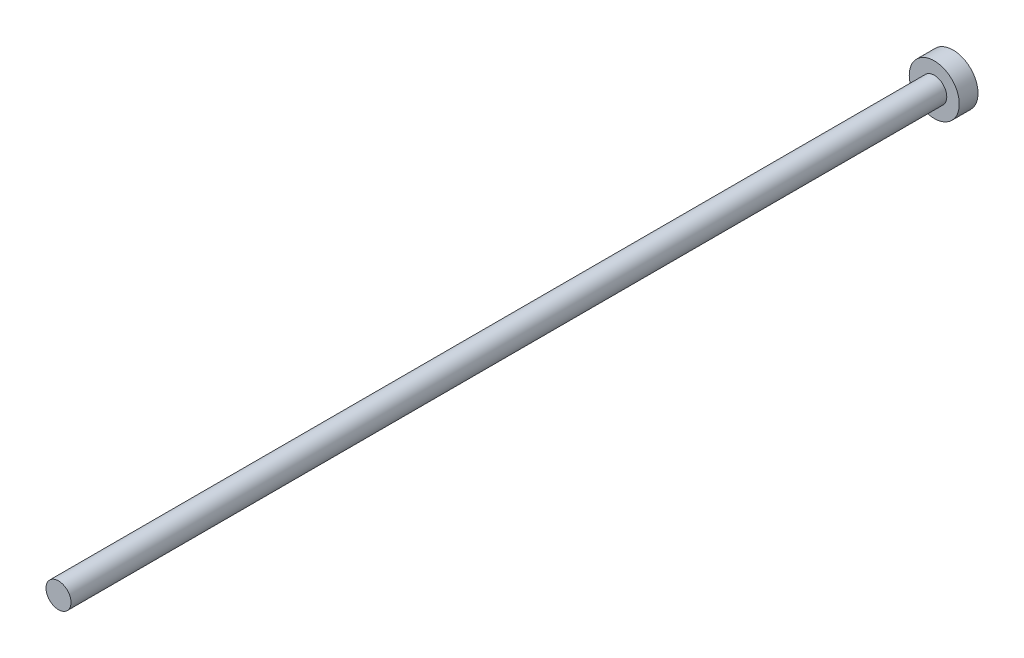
ISO-10303-21;
HEADER;
FILE_DESCRIPTION(('STEP AP214'),'2;1');
FILE_NAME('part.step','',(''),(''),'','','');
FILE_SCHEMA(('AUTOMOTIVE_DESIGN { 1 0 10303 214 1 1 1 1 }'));
ENDSEC;
DATA;
#1=APPLICATION_CONTEXT('core data for automotive mechanical design processes');
#2=APPLICATION_PROTOCOL_DEFINITION('international standard','automotive_design',2000,#1);
#3=PRODUCT_CONTEXT('',#1,'mechanical');
#4=PRODUCT('Part','Part','',(#3));
#5=PRODUCT_RELATED_PRODUCT_CATEGORY('part','',(#4));
#6=PRODUCT_DEFINITION_FORMATION('','',#4);
#7=PRODUCT_DEFINITION_CONTEXT('part definition',#1,'design');
#8=PRODUCT_DEFINITION('design','',#6,#7);
#9=PRODUCT_DEFINITION_SHAPE('','',#8);
#10=(LENGTH_UNIT() NAMED_UNIT(*) SI_UNIT(.MILLI.,.METRE.));
#11=(NAMED_UNIT(*) PLANE_ANGLE_UNIT() SI_UNIT($,.RADIAN.));
#12=(NAMED_UNIT(*) SI_UNIT($,.STERADIAN.) SOLID_ANGLE_UNIT());
#13=UNCERTAINTY_MEASURE_WITH_UNIT(LENGTH_MEASURE(1.E-05),#10,'distance_accuracy_value','');
#14=(GEOMETRIC_REPRESENTATION_CONTEXT(3) GLOBAL_UNCERTAINTY_ASSIGNED_CONTEXT((#13)) GLOBAL_UNIT_ASSIGNED_CONTEXT((#10,
#11,#12)) REPRESENTATION_CONTEXT('',''));
#15=CARTESIAN_POINT('',(0.,0.,0.));
#16=DIRECTION('',(0.,0.,1.));
#17=DIRECTION('',(1.,0.,0.));
#18=AXIS2_PLACEMENT_3D('',#15,#16,#17);
#19=CARTESIAN_POINT('',(80.0000083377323,36.261,-1415.7));
#20=DIRECTION('',(0.,0.,1.));
#21=DIRECTION('',(1.,0.,0.));
#22=AXIS2_PLACEMENT_3D('',#19,#20,#21);
#23=CYLINDRICAL_SURFACE('',#22,2.);
#24=CARTESIAN_POINT('',(80.0000083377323,36.261,0.));
#25=DIRECTION('',(0.,0.,-1.));
#26=DIRECTION('',(1.,0.,0.));
#27=AXIS2_PLACEMENT_3D('',#24,#25,#26);
#28=CIRCLE('',#27,2.);
#29=CARTESIAN_POINT('',(82.0000083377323,36.261,0.));
#30=VERTEX_POINT('',#29);
#31=EDGE_CURVE('E20',#30,#30,#28,.T.);
#32=ORIENTED_EDGE('',*,*,#31,.T.);
#33=EDGE_LOOP('',(#32));
#34=FACE_BOUND('',#33,.T.);
#35=CARTESIAN_POINT('',(80.0000083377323,36.261,-140.));
#36=DIRECTION('',(0.,0.,-1.));
#37=DIRECTION('',(-1.,0.,0.));
#38=AXIS2_PLACEMENT_3D('',#35,#36,#37);
#39=CIRCLE('',#38,2.);
#40=CARTESIAN_POINT('',(78.0000083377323,36.261,-140.));
#41=VERTEX_POINT('',#40);
#42=EDGE_CURVE('E10',#41,#41,#39,.T.);
#43=ORIENTED_EDGE('',*,*,#42,.F.);
#44=EDGE_LOOP('',(#43));
#45=FACE_BOUND('',#44,.T.);
#46=ADVANCED_FACE('F14',(#34,#45),#23,.T.);
#47=CARTESIAN_POINT('',(80.0000083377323,36.261,0.));
#48=DIRECTION('',(0.,0.,-1.));
#49=DIRECTION('',(-1.,0.,0.));
#50=AXIS2_PLACEMENT_3D('',#47,#48,#49);
#51=PLANE('',#50);
#52=ORIENTED_EDGE('',*,*,#31,.F.);
#53=EDGE_LOOP('',(#52));
#54=FACE_BOUND('',#53,.T.);
#55=ADVANCED_FACE('F46',(#54),#51,.F.);
#56=CARTESIAN_POINT('',(11.2500080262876,30.,-140.));
#57=DIRECTION('',(0.,0.,-1.));
#58=DIRECTION('',(-1.,0.,0.));
#59=AXIS2_PLACEMENT_3D('',#56,#57,#58);
#60=PLANE('',#59);
#61=CARTESIAN_POINT('',(80.0000083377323,36.261,-140.));
#62=DIRECTION('',(0.,0.,-1.));
#63=DIRECTION('',(-1.,0.,0.));
#64=AXIS2_PLACEMENT_3D('',#61,#62,#63);
#65=CIRCLE('',#64,4.);
#66=CARTESIAN_POINT('',(76.0000083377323,36.261,-140.));
#67=VERTEX_POINT('',#66);
#68=EDGE_CURVE('E24',#67,#67,#65,.T.);
#69=ORIENTED_EDGE('',*,*,#68,.F.);
#70=EDGE_LOOP('',(#69));
#71=FACE_BOUND('',#70,.T.);
#72=ORIENTED_EDGE('',*,*,#42,.T.);
#73=EDGE_LOOP('',(#72));
#74=FACE_BOUND('',#73,.T.);
#75=ADVANCED_FACE('F38',(#71,#74),#60,.F.);
#76=CARTESIAN_POINT('',(80.0000083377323,36.261,-140.));
#77=DIRECTION('',(0.,0.,-1.));
#78=DIRECTION('',(-1.,0.,0.));
#79=AXIS2_PLACEMENT_3D('',#76,#77,#78);
#80=CYLINDRICAL_SURFACE('',#79,4.);
#81=ORIENTED_EDGE('',*,*,#68,.T.);
#82=EDGE_LOOP('',(#81));
#83=FACE_BOUND('',#82,.T.);
#84=CARTESIAN_POINT('',(80.0000083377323,36.261,-143.));
#85=DIRECTION('',(0.,0.,-1.));
#86=DIRECTION('',(-1.,0.,0.));
#87=AXIS2_PLACEMENT_3D('',#84,#85,#86);
#88=CIRCLE('',#87,4.);
#89=CARTESIAN_POINT('',(76.0000083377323,36.261,-143.));
#90=VERTEX_POINT('',#89);
#91=EDGE_CURVE('E28',#90,#90,#88,.T.);
#92=ORIENTED_EDGE('',*,*,#91,.F.);
#93=EDGE_LOOP('',(#92));
#94=FACE_BOUND('',#93,.T.);
#95=ADVANCED_FACE('F36',(#83,#94),#80,.T.);
#96=CARTESIAN_POINT('',(11.2500080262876,30.,-143.));
#97=DIRECTION('',(0.,0.,-1.));
#98=DIRECTION('',(-1.,0.,0.));
#99=AXIS2_PLACEMENT_3D('',#96,#97,#98);
#100=PLANE('',#99);
#101=ORIENTED_EDGE('',*,*,#91,.T.);
#102=EDGE_LOOP('',(#101));
#103=FACE_BOUND('',#102,.T.);
#104=ADVANCED_FACE('F34',(#103),#100,.T.);
#105=CLOSED_SHELL('',(#46,#55,#75,#95,#104));
#106=MANIFOLD_SOLID_BREP('B1',#105);
#107=ADVANCED_BREP_SHAPE_REPRESENTATION('',(#18,#106),#14);
#108=SHAPE_DEFINITION_REPRESENTATION(#9,#107);
ENDSEC;
END-ISO-10303-21;
